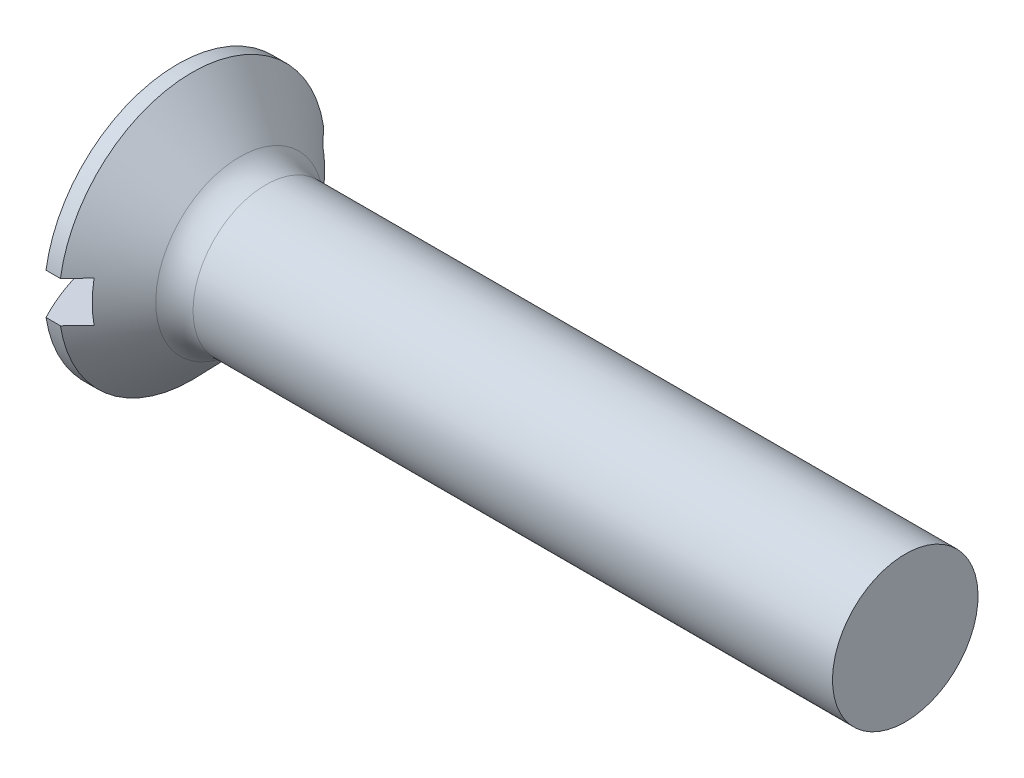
ISO-10303-21;
HEADER;
FILE_DESCRIPTION(('STEP AP214'),'2;1');
FILE_NAME('part.step','',(''),(''),'','','');
FILE_SCHEMA(('AUTOMOTIVE_DESIGN { 1 0 10303 214 1 1 1 1 }'));
ENDSEC;
DATA;
#1=APPLICATION_CONTEXT('core data for automotive mechanical design processes');
#2=APPLICATION_PROTOCOL_DEFINITION('international standard','automotive_design',2000,#1);
#3=PRODUCT_CONTEXT('',#1,'mechanical');
#4=PRODUCT('Part','Part','',(#3));
#5=PRODUCT_RELATED_PRODUCT_CATEGORY('part','',(#4));
#6=PRODUCT_DEFINITION_FORMATION('','',#4);
#7=PRODUCT_DEFINITION_CONTEXT('part definition',#1,'design');
#8=PRODUCT_DEFINITION('design','',#6,#7);
#9=PRODUCT_DEFINITION_SHAPE('','',#8);
#10=(LENGTH_UNIT() NAMED_UNIT(*) SI_UNIT(.MILLI.,.METRE.));
#11=(NAMED_UNIT(*) PLANE_ANGLE_UNIT() SI_UNIT($,.RADIAN.));
#12=(NAMED_UNIT(*) SI_UNIT($,.STERADIAN.) SOLID_ANGLE_UNIT());
#13=UNCERTAINTY_MEASURE_WITH_UNIT(LENGTH_MEASURE(1.E-05),#10,'distance_accuracy_value','');
#14=(GEOMETRIC_REPRESENTATION_CONTEXT(3) GLOBAL_UNCERTAINTY_ASSIGNED_CONTEXT((#13)) GLOBAL_UNIT_ASSIGNED_CONTEXT((#10,
#11,#12)) REPRESENTATION_CONTEXT('',''));
#15=CARTESIAN_POINT('',(0.,0.,0.));
#16=DIRECTION('',(0.,0.,1.));
#17=DIRECTION('',(1.,0.,0.));
#18=AXIS2_PLACEMENT_3D('',#15,#16,#17);
#19=CARTESIAN_POINT('',(19.5,0.,0.));
#20=DIRECTION('',(-1.,0.,0.));
#21=DIRECTION('',(0.,1.,0.));
#22=AXIS2_PLACEMENT_3D('',#19,#20,#21);
#23=SPHERICAL_SURFACE('',#22,19.5);
#24=CARTESIAN_POINT('',(19.5,-1.405,0.));
#25=DIRECTION('',(0.,1.,0.));
#26=DIRECTION('',(0.,0.,1.));
#27=AXIS2_PLACEMENT_3D('',#24,#25,#26);
#28=CIRCLE('',#27,19.4493181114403);
#29=CARTESIAN_POINT('',(2.28002613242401,-1.405,-9.04148632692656));
#30=VERTEX_POINT('',#29);
#31=CARTESIAN_POINT('',(2.28002613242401,-1.405,9.04148632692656));
#32=VERTEX_POINT('',#31);
#33=EDGE_CURVE('E129',#30,#32,#28,.T.);
#34=ORIENTED_EDGE('',*,*,#33,.F.);
#35=CARTESIAN_POINT('',(2.28002613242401,0.,0.));
#36=DIRECTION('',(-1.,0.,0.));
#37=DIRECTION('',(0.,-1.,0.));
#38=AXIS2_PLACEMENT_3D('',#35,#36,#37);
#39=CIRCLE('',#38,9.15);
#40=EDGE_CURVE('E119',#30,#32,#39,.T.);
#41=ORIENTED_EDGE('',*,*,#40,.T.);
#42=EDGE_LOOP('',(#34,#41));
#43=FACE_BOUND('',#42,.T.);
#44=ADVANCED_FACE('F33',(#43),#23,.T.);
#45=CARTESIAN_POINT('',(19.5,1.405,0.));
#46=DIRECTION('',(0.,-1.,0.));
#47=DIRECTION('',(0.,0.,-1.));
#48=AXIS2_PLACEMENT_3D('',#45,#46,#47);
#49=CIRCLE('',#48,19.4493181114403);
#50=CARTESIAN_POINT('',(2.28002613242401,1.405,9.04148632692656));
#51=VERTEX_POINT('',#50);
#52=CARTESIAN_POINT('',(2.28002613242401,1.405,-9.04148632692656));
#53=VERTEX_POINT('',#52);
#54=EDGE_CURVE('E135',#51,#53,#49,.T.);
#55=ORIENTED_EDGE('',*,*,#54,.F.);
#56=EDGE_CURVE('E116',#51,#53,#39,.T.);
#57=ORIENTED_EDGE('',*,*,#56,.T.);
#58=EDGE_LOOP('',(#55,#57));
#59=FACE_BOUND('',#58,.T.);
#60=ADVANCED_FACE('F150',(#59),#23,.T.);
#61=CARTESIAN_POINT('',(2.28002613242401,0.,0.));
#62=DIRECTION('',(-1.,0.,0.));
#63=DIRECTION('',(0.,-1.,0.));
#64=AXIS2_PLACEMENT_3D('',#61,#62,#63);
#65=CYLINDRICAL_SURFACE('',#64,9.15);
#66=DIRECTION('',(-1.,0.,0.));
#67=VECTOR('',#66,1.);
#68=CARTESIAN_POINT('',(2.28002613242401,-1.405,-9.04148632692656));
#69=LINE('',#68,#67);
#70=CARTESIAN_POINT('',(3.27241771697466,-1.405,-9.04148632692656));
#71=VERTEX_POINT('',#70);
#72=EDGE_CURVE('E131',#71,#30,#69,.T.);
#73=ORIENTED_EDGE('',*,*,#72,.F.);
#74=CARTESIAN_POINT('',(3.27241771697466,0.,0.));
#75=DIRECTION('',(-1.,0.,0.));
#76=DIRECTION('',(0.,-1.,0.));
#77=AXIS2_PLACEMENT_3D('',#74,#75,#76);
#78=CIRCLE('',#77,9.15);
#79=CARTESIAN_POINT('',(3.27241771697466,-1.405,9.04148632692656));
#80=VERTEX_POINT('',#79);
#81=EDGE_CURVE('E123',#71,#80,#78,.T.);
#82=ORIENTED_EDGE('',*,*,#81,.T.);
#83=DIRECTION('',(-1.,0.,0.));
#84=VECTOR('',#83,1.);
#85=CARTESIAN_POINT('',(2.28002613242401,-1.405,9.04148632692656));
#86=LINE('',#85,#84);
#87=EDGE_CURVE('E62',#32,#80,#86,.F.);
#88=ORIENTED_EDGE('',*,*,#87,.F.);
#89=ORIENTED_EDGE('',*,*,#40,.F.);
#90=EDGE_LOOP('',(#73,#82,#88,#89));
#91=FACE_BOUND('',#90,.T.);
#92=ADVANCED_FACE('F152',(#91),#65,.T.);
#93=DIRECTION('',(-1.,0.,0.));
#94=VECTOR('',#93,1.);
#95=CARTESIAN_POINT('',(2.28002613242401,1.405,9.04148632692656));
#96=LINE('',#95,#94);
#97=CARTESIAN_POINT('',(3.27241771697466,1.405,9.04148632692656));
#98=VERTEX_POINT('',#97);
#99=EDGE_CURVE('E137',#98,#51,#96,.T.);
#100=ORIENTED_EDGE('',*,*,#99,.F.);
#101=CARTESIAN_POINT('',(3.27241771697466,1.405,-9.04148632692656));
#102=VERTEX_POINT('',#101);
#103=EDGE_CURVE('E122',#98,#102,#78,.T.);
#104=ORIENTED_EDGE('',*,*,#103,.T.);
#105=DIRECTION('',(-1.,0.,0.));
#106=VECTOR('',#105,1.);
#107=CARTESIAN_POINT('',(2.28002613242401,1.405,-9.04148632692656));
#108=LINE('',#107,#106);
#109=EDGE_CURVE('E133',#53,#102,#108,.F.);
#110=ORIENTED_EDGE('',*,*,#109,.F.);
#111=ORIENTED_EDGE('',*,*,#56,.F.);
#112=EDGE_LOOP('',(#100,#104,#110,#111));
#113=FACE_BOUND('',#112,.T.);
#114=ADVANCED_FACE('F145',(#113),#65,.T.);
#115=CARTESIAN_POINT('',(7.28002613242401,0.,0.));
#116=DIRECTION('',(-1.,0.,0.));
#117=DIRECTION('',(0.,-1.,0.));
#118=AXIS2_PLACEMENT_3D('',#115,#116,#117);
#119=CONICAL_SURFACE('',#118,5.,0.802851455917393);
#120=CARTESIAN_POINT('',(6.54286367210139,0.,0.));
#121=DIRECTION('',(-1.,0.,0.));
#122=DIRECTION('',(0.,-1.,0.));
#123=AXIS2_PLACEMENT_3D('',#120,#121,#122);
#124=CIRCLE('',#123,5.76335407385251);
#125=CARTESIAN_POINT('',(6.54286367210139,-5.76335407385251,0.));
#126=VERTEX_POINT('',#125);
#127=EDGE_CURVE('E112',#126,#126,#124,.T.);
#128=ORIENTED_EDGE('',*,*,#127,.T.);
#129=EDGE_LOOP('',(#128));
#130=FACE_BOUND('',#129,.T.);
#131=CARTESIAN_POINT('',(-7.39839007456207,-1.405,20.1510235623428));
#132=CARTESIAN_POINT('',(-6.71531421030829,-1.405,19.4419459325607));
#133=CARTESIAN_POINT('',(-6.03231499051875,-1.405,18.7327944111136));
#134=CARTESIAN_POINT('',(-4.6665504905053,-1.405,17.3142214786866));
#135=CARTESIAN_POINT('',(-3.9837852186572,-1.405,16.604800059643));
#136=CARTESIAN_POINT('',(-2.61810862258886,-1.405,15.1850862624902));
#137=CARTESIAN_POINT('',(-1.93519756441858,-1.405,14.4747936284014));
#138=CARTESIAN_POINT('',(-0.56995355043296,-1.405,13.0536965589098));
#139=CARTESIAN_POINT('',(0.112379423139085,-1.405,12.342892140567));
#140=CARTESIAN_POINT('',(1.46795705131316,-1.405,10.9289617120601));
#141=CARTESIAN_POINT('',(2.14121244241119,-1.405,10.2258460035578));
#142=CARTESIAN_POINT('',(3.14991742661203,-1.405,9.1699806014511));
#143=CARTESIAN_POINT('',(3.48597254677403,-1.405,8.8178095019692));
#144=CARTESIAN_POINT('',(4.15749783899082,-1.405,8.11291635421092));
#145=CARTESIAN_POINT('',(4.49296801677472,-1.405,7.76019431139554));
#146=CARTESIAN_POINT('',(5.16289211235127,-1.405,7.05409748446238));
#147=CARTESIAN_POINT('',(5.49734642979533,-1.405,6.70072307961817));
#148=CARTESIAN_POINT('',(6.16493175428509,-1.405,5.99269868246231));
#149=CARTESIAN_POINT('',(6.49806271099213,-1.405,5.63804864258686));
#150=CARTESIAN_POINT('',(6.9959956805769,-1.405,5.10448322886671));
#151=CARTESIAN_POINT('',(7.16166553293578,-1.405,4.92637811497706));
#152=CARTESIAN_POINT('',(7.49220461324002,-1.405,4.56942691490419));
#153=CARTESIAN_POINT('',(7.65707384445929,-1.405,4.39058083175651));
#154=CARTESIAN_POINT('',(7.9856749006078,-1.405,4.03186599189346));
#155=CARTESIAN_POINT('',(8.14940679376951,-1.405,3.85199729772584));
#156=CARTESIAN_POINT('',(8.47521264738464,-1.405,3.49076595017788));
#157=CARTESIAN_POINT('',(8.637286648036,-1.405,3.30940333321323));
#158=CARTESIAN_POINT('',(8.83988374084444,-1.405,3.07939528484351));
#159=CARTESIAN_POINT('',(8.88162752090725,-1.405,3.03182493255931));
#160=CARTESIAN_POINT('',(8.96490930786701,-1.405,2.93650419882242));
#161=CARTESIAN_POINT('',(9.00644731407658,-1.405,2.88875381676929));
#162=CARTESIAN_POINT('',(9.13071566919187,-1.405,2.7451942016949));
#163=CARTESIAN_POINT('',(9.21309615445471,-1.405,2.64908125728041));
#164=CARTESIAN_POINT('',(9.37685447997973,-1.405,2.45551219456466));
#165=CARTESIAN_POINT('',(9.45822861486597,-1.405,2.35805293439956));
#166=CARTESIAN_POINT('',(9.61924074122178,-1.405,2.16172699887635));
#167=CARTESIAN_POINT('',(9.69887896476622,-1.405,2.06286051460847));
#168=CARTESIAN_POINT('',(9.84897776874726,-1.405,1.87172069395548));
#169=CARTESIAN_POINT('',(9.91964056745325,-1.405,1.77960706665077));
#170=CARTESIAN_POINT('',(10.0579680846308,-1.405,1.59316847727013));
#171=CARTESIAN_POINT('',(10.1256333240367,-1.405,1.49884390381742));
#172=CARTESIAN_POINT('',(10.2563922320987,-1.405,1.30723742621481));
#173=CARTESIAN_POINT('',(10.3194929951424,-1.405,1.20996046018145));
#174=CARTESIAN_POINT('',(10.4087569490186,-1.405,1.0608681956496));
#175=CARTESIAN_POINT('',(10.4375998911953,-1.405,1.01066871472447));
#176=CARTESIAN_POINT('',(10.4929757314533,-1.405,0.909017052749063));
#177=CARTESIAN_POINT('',(10.5195084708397,-1.405,0.857564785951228));
#178=CARTESIAN_POINT('',(10.5888944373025,-1.405,0.713098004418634));
#179=CARTESIAN_POINT('',(10.6286443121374,-1.405,0.618492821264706));
#180=CARTESIAN_POINT('',(10.6774849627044,-1.405,0.473112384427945));
#181=CARTESIAN_POINT('',(10.6919552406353,-1.405,0.424143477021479));
#182=CARTESIAN_POINT('',(10.7165842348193,-1.405,0.325145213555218));
#183=CARTESIAN_POINT('',(10.7267461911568,-1.405,0.275116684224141));
#184=CARTESIAN_POINT('',(10.7409430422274,-1.405,0.182029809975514));
#185=CARTESIAN_POINT('',(10.7456783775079,-1.405,0.139078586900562));
#186=CARTESIAN_POINT('',(10.7513488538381,-1.405,0.0529264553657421));
#187=CARTESIAN_POINT('',(10.7522845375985,-1.405,0.00972558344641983));
#188=CARTESIAN_POINT('',(10.7503022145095,-1.405,-0.0765762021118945));
#189=CARTESIAN_POINT('',(10.7473851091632,-1.405,-0.119677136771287));
#190=CARTESIAN_POINT('',(10.7378638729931,-1.405,-0.205469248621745));
#191=CARTESIAN_POINT('',(10.7312590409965,-1.405,-0.248160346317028));
#192=CARTESIAN_POINT('',(10.7116564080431,-1.405,-0.348398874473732));
#193=CARTESIAN_POINT('',(10.6972032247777,-1.405,-0.405661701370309));
#194=CARTESIAN_POINT('',(10.6631218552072,-1.405,-0.518634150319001));
#195=CARTESIAN_POINT('',(10.6434894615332,-1.405,-0.574342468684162));
#196=CARTESIAN_POINT('',(10.6000352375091,-1.405,-0.684435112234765));
#197=CARTESIAN_POINT('',(10.5761907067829,-1.405,-0.738810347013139));
#198=CARTESIAN_POINT('',(10.525331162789,-1.405,-0.846019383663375));
#199=CARTESIAN_POINT('',(10.4983170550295,-1.405,-0.898853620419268));
#200=CARTESIAN_POINT('',(10.442706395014,-1.405,-1.00158712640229));
#201=CARTESIAN_POINT('',(10.4141837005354,-1.405,-1.05152672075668));
#202=CARTESIAN_POINT('',(10.3553304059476,-1.405,-1.1503329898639));
#203=CARTESIAN_POINT('',(10.3249995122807,-1.405,-1.19919948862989));
#204=CARTESIAN_POINT('',(10.2318456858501,-1.405,-1.34449877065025));
#205=CARTESIAN_POINT('',(10.1668980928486,-1.405,-1.43956637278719));
#206=CARTESIAN_POINT('',(10.0332082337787,-1.405,-1.62731827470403));
#207=CARTESIAN_POINT('',(9.96445668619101,-1.405,-1.71999585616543));
#208=CARTESIAN_POINT('',(9.82445560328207,-1.405,-1.90345529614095));
#209=CARTESIAN_POINT('',(9.75320575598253,-1.405,-1.99423691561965));
#210=CARTESIAN_POINT('',(9.60862433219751,-1.405,-2.17479145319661));
#211=CARTESIAN_POINT('',(9.53528483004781,-1.405,-2.26455799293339));
#212=CARTESIAN_POINT('',(9.3873025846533,-1.405,-2.44302060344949));
#213=CARTESIAN_POINT('',(9.31265973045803,-1.405,-2.53171658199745));
#214=CARTESIAN_POINT('',(9.16253475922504,-1.405,-2.70811752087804));
#215=CARTESIAN_POINT('',(9.08705440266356,-1.405,-2.79582398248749));
#216=CARTESIAN_POINT('',(8.93534550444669,-1.405,-2.97058132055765));
#217=CARTESIAN_POINT('',(8.85911698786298,-1.405,-3.05763221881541));
#218=CARTESIAN_POINT('',(8.63162195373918,-1.405,-3.31566553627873));
#219=CARTESIAN_POINT('',(8.47950949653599,-1.405,-3.48590171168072));
#220=CARTESIAN_POINT('',(8.17380248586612,-1.405,-3.82503932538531));
#221=CARTESIAN_POINT('',(8.02020790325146,-1.405,-3.99394073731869));
#222=CARTESIAN_POINT('',(7.7119803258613,-1.405,-4.3308127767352));
#223=CARTESIAN_POINT('',(7.55734726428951,-1.405,-4.49878334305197));
#224=CARTESIAN_POINT('',(7.24733874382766,-1.405,-4.83403834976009));
#225=CARTESIAN_POINT('',(7.09196328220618,-1.405,-5.00132278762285));
#226=CARTESIAN_POINT('',(6.62476963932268,-1.405,-5.50268524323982));
#227=CARTESIAN_POINT('',(6.31213381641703,-1.405,-5.8360010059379));
#228=CARTESIAN_POINT('',(5.68558901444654,-1.405,-6.50140825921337));
#229=CARTESIAN_POINT('',(5.37168008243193,-1.405,-6.83349979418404));
#230=CARTESIAN_POINT('',(4.74470671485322,-1.405,-7.49511392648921));
#231=CARTESIAN_POINT('',(4.43164674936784,-1.405,-7.82464076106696));
#232=CARTESIAN_POINT('',(3.80495649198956,-1.405,-8.48315736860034));
#233=CARTESIAN_POINT('',(3.49132619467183,-1.405,-8.81214713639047));
#234=CARTESIAN_POINT('',(2.55001232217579,-1.405,-9.79836333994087));
#235=CARTESIAN_POINT('',(1.92173176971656,-1.405,-10.4550198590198));
#236=CARTESIAN_POINT('',(0.57207063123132,-1.405,-11.8637518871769));
#237=CARTESIAN_POINT('',(-0.149447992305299,-1.405,-12.6156950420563));
#238=CARTESIAN_POINT('',(-1.59322919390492,-1.405,-14.1190060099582));
#239=CARTESIAN_POINT('',(-2.31549183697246,-1.405,-14.8703737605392));
#240=CARTESIAN_POINT('',(-3.76439792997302,-1.405,-16.3768173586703));
#241=CARTESIAN_POINT('',(-4.49104370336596,-1.405,-17.131890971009));
#242=CARTESIAN_POINT('',(-5.94456176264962,-1.405,-18.6416778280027));
#243=CARTESIAN_POINT('',(-6.67143401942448,-1.405,-19.3963911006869));
#244=CARTESIAN_POINT('',(-7.39839007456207,-1.405,-20.1510235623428));
#245=B_SPLINE_CURVE_WITH_KNOTS('',3,(#131,#132,#133,#134,#135,#136,#137,#138,#139,#140,#141,
#142,#143,#144,#145,#146,#147,#148,#149,#150,#151,#152,#153,#154,#155,#156,#157,#158,#159,#160,
#161,#162,#163,#164,#165,#166,#167,#168,#169,#170,#171,#172,#173,#174,#175,#176,#177,#178,#179,
#180,#181,#182,#183,#184,#185,#186,#187,#188,#189,#190,#191,#192,#193,#194,#195,#196,#197,#198,
#199,#200,#201,#202,#203,#204,#205,#206,#207,#208,#209,#210,#211,#212,#213,#214,#215,#216,#217,
#218,#219,#220,#221,#222,#223,#224,#225,#226,#227,#228,#229,#230,#231,#232,#233,#234,#235,#236,
#237,#238,#239,#240,#241,#242,#243,#244),.UNSPECIFIED.,.F.,.F.,(4,2,2,2,2,2,2,2,2,2,2,2,2,2,2,2,
2,2,2,2,2,2,2,2,2,2,2,2,2,2,2,2,2,2,2,2,2,2,2,2,2,2,2,2,2,2,2,2,2,2,2,2,2,2,2,2,4),(0.,
2.95371864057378,5.90753382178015,8.86353566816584,11.8194431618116,14.7398524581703,
16.2002005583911,17.6605342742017,19.120189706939,20.5799001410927,21.3096323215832,
22.0393615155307,22.769046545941,23.4987138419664,23.6885799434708,23.878446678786,
24.2581991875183,24.6390797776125,25.0199091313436,25.3681523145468,25.7163347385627,
26.0639638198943,26.2375946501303,26.4112373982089,26.7181513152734,26.8711861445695,
27.0241056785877,27.1535838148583,27.2830434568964,27.4124728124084,27.5419267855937,
27.7187869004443,27.8957911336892,28.073780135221,28.251718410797,28.4242040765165,
28.596717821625,28.9419684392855,29.2881021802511,29.6342793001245,29.98201438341,
30.3297792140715,30.6769155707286,31.0240403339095,31.7089093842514,32.3937919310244,
33.078718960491,33.763648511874,35.1346137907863,36.5055288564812,37.8691077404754,
39.2326996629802,41.9591255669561,45.0854757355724,48.2121272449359,51.3559070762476,
54.4993793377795),.UNSPECIFIED.);
#246=CARTESIAN_POINT('',(4.4,-1.405,7.85773225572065));
#247=VERTEX_POINT('',#246);
#248=EDGE_CURVE('E11',#80,#247,#245,.T.);
#249=ORIENTED_EDGE('',*,*,#248,.F.);
#250=ORIENTED_EDGE('',*,*,#81,.F.);
#251=CARTESIAN_POINT('',(4.4,-1.405,-7.85773225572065));
#252=VERTEX_POINT('',#251);
#253=EDGE_CURVE('E37',#252,#71,#245,.T.);
#254=ORIENTED_EDGE('',*,*,#253,.F.);
#255=CARTESIAN_POINT('',(4.4,0.,0.));
#256=DIRECTION('',(1.,0.,0.));
#257=DIRECTION('',(0.,0.,-1.));
#258=AXIS2_PLACEMENT_3D('',#255,#256,#257);
#259=CIRCLE('',#258,7.98235436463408);
#260=CARTESIAN_POINT('',(4.4,1.405,-7.85773225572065));
#261=VERTEX_POINT('',#260);
#262=EDGE_CURVE('E101',#252,#261,#259,.T.);
#263=ORIENTED_EDGE('',*,*,#262,.T.);
#264=CARTESIAN_POINT('',(-7.39839007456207,1.405,-20.1510235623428));
#265=CARTESIAN_POINT('',(-6.71531421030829,1.405,-19.4419459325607));
#266=CARTESIAN_POINT('',(-6.03231499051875,1.405,-18.7327944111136));
#267=CARTESIAN_POINT('',(-4.66655049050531,1.405,-17.3142214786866));
#268=CARTESIAN_POINT('',(-3.98378521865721,1.405,-16.604800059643));
#269=CARTESIAN_POINT('',(-2.61810862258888,1.405,-15.1850862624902));
#270=CARTESIAN_POINT('',(-1.9351975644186,1.405,-14.4747936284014));
#271=CARTESIAN_POINT('',(-0.569953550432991,1.405,-13.0536965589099));
#272=CARTESIAN_POINT('',(0.112379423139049,1.405,-12.342892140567));
#273=CARTESIAN_POINT('',(1.46795705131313,1.405,-10.9289617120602));
#274=CARTESIAN_POINT('',(2.14121244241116,1.405,-10.2258460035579));
#275=CARTESIAN_POINT('',(3.149917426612,1.405,-9.16998060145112));
#276=CARTESIAN_POINT('',(3.48597254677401,1.405,-8.81780950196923));
#277=CARTESIAN_POINT('',(4.15749783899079,1.405,-8.11291635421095));
#278=CARTESIAN_POINT('',(4.4929680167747,1.405,-7.76019431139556));
#279=CARTESIAN_POINT('',(5.16289211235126,1.405,-7.0540974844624));
#280=CARTESIAN_POINT('',(5.49734642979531,1.405,-6.70072307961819));
#281=CARTESIAN_POINT('',(6.16493175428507,1.405,-5.99269868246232));
#282=CARTESIAN_POINT('',(6.49806271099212,1.405,-5.63804864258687));
#283=CARTESIAN_POINT('',(6.99599568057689,1.405,-5.10448322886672));
#284=CARTESIAN_POINT('',(7.16166553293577,1.405,-4.92637811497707));
#285=CARTESIAN_POINT('',(7.49220461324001,1.405,-4.5694269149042));
#286=CARTESIAN_POINT('',(7.65707384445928,1.405,-4.39058083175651));
#287=CARTESIAN_POINT('',(7.9856749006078,1.405,-4.03186599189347));
#288=CARTESIAN_POINT('',(8.14940679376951,1.405,-3.85199729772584));
#289=CARTESIAN_POINT('',(8.47521264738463,1.405,-3.49076595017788));
#290=CARTESIAN_POINT('',(8.637286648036,1.405,-3.30940333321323));
#291=CARTESIAN_POINT('',(8.83988374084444,1.405,-3.07939528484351));
#292=CARTESIAN_POINT('',(8.88162752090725,1.405,-3.03182493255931));
#293=CARTESIAN_POINT('',(8.96490930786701,1.405,-2.93650419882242));
#294=CARTESIAN_POINT('',(9.00644731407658,1.405,-2.88875381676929));
#295=CARTESIAN_POINT('',(9.13071566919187,1.405,-2.7451942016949));
#296=CARTESIAN_POINT('',(9.21309615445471,1.405,-2.64908125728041));
#297=CARTESIAN_POINT('',(9.37685447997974,1.405,-2.45551219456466));
#298=CARTESIAN_POINT('',(9.45822861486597,1.405,-2.35805293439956));
#299=CARTESIAN_POINT('',(9.61924074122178,1.405,-2.16172699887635));
#300=CARTESIAN_POINT('',(9.69887896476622,1.405,-2.06286051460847));
#301=CARTESIAN_POINT('',(9.84897776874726,1.405,-1.87172069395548));
#302=CARTESIAN_POINT('',(9.91964056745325,1.405,-1.77960706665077));
#303=CARTESIAN_POINT('',(10.0579680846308,1.405,-1.59316847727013));
#304=CARTESIAN_POINT('',(10.1256333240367,1.405,-1.49884390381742));
#305=CARTESIAN_POINT('',(10.2563922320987,1.405,-1.30723742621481));
#306=CARTESIAN_POINT('',(10.3194929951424,1.405,-1.20996046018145));
#307=CARTESIAN_POINT('',(10.4087569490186,1.405,-1.0608681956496));
#308=CARTESIAN_POINT('',(10.4375998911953,1.405,-1.01066871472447));
#309=CARTESIAN_POINT('',(10.4929757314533,1.405,-0.909017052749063));
#310=CARTESIAN_POINT('',(10.5195084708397,1.405,-0.857564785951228));
#311=CARTESIAN_POINT('',(10.5888944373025,1.405,-0.713098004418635));
#312=CARTESIAN_POINT('',(10.6286443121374,1.405,-0.618492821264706));
#313=CARTESIAN_POINT('',(10.6774849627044,1.405,-0.473112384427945));
#314=CARTESIAN_POINT('',(10.6919552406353,1.405,-0.424143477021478));
#315=CARTESIAN_POINT('',(10.7165842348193,1.405,-0.325145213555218));
#316=CARTESIAN_POINT('',(10.7267461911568,1.405,-0.275116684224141));
#317=CARTESIAN_POINT('',(10.7409430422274,1.405,-0.182029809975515));
#318=CARTESIAN_POINT('',(10.7456783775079,1.405,-0.139078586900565));
#319=CARTESIAN_POINT('',(10.7513488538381,1.405,-0.0529264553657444));
#320=CARTESIAN_POINT('',(10.7522845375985,1.405,-0.00972558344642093));
#321=CARTESIAN_POINT('',(10.7503022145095,1.405,0.0765762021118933));
#322=CARTESIAN_POINT('',(10.7473851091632,1.405,0.119677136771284));
#323=CARTESIAN_POINT('',(10.7378638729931,1.405,0.205469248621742));
#324=CARTESIAN_POINT('',(10.7312590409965,1.405,0.248160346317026));
#325=CARTESIAN_POINT('',(10.7116564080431,1.405,0.348398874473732));
#326=CARTESIAN_POINT('',(10.6972032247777,1.405,0.405661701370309));
#327=CARTESIAN_POINT('',(10.6631218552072,1.405,0.518634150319));
#328=CARTESIAN_POINT('',(10.6434894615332,1.405,0.574342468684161));
#329=CARTESIAN_POINT('',(10.6000352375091,1.405,0.684435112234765));
#330=CARTESIAN_POINT('',(10.5761907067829,1.405,0.738810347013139));
#331=CARTESIAN_POINT('',(10.525331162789,1.405,0.846019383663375));
#332=CARTESIAN_POINT('',(10.4983170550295,1.405,0.898853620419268));
#333=CARTESIAN_POINT('',(10.442706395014,1.405,1.00158712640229));
#334=CARTESIAN_POINT('',(10.4141837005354,1.405,1.05152672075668));
#335=CARTESIAN_POINT('',(10.3553304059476,1.405,1.1503329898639));
#336=CARTESIAN_POINT('',(10.3249995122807,1.405,1.19919948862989));
#337=CARTESIAN_POINT('',(10.2318456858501,1.405,1.34449877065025));
#338=CARTESIAN_POINT('',(10.1668980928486,1.405,1.4395663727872));
#339=CARTESIAN_POINT('',(10.0332082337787,1.405,1.62731827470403));
#340=CARTESIAN_POINT('',(9.964456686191,1.405,1.71999585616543));
#341=CARTESIAN_POINT('',(9.82445560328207,1.405,1.90345529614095));
#342=CARTESIAN_POINT('',(9.75320575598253,1.405,1.99423691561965));
#343=CARTESIAN_POINT('',(9.60862433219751,1.405,2.17479145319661));
#344=CARTESIAN_POINT('',(9.53528483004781,1.405,2.26455799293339));
#345=CARTESIAN_POINT('',(9.3873025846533,1.405,2.44302060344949));
#346=CARTESIAN_POINT('',(9.31265973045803,1.405,2.53171658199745));
#347=CARTESIAN_POINT('',(9.16253475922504,1.405,2.70811752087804));
#348=CARTESIAN_POINT('',(9.08705440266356,1.405,2.7958239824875));
#349=CARTESIAN_POINT('',(8.93534550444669,1.405,2.97058132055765));
#350=CARTESIAN_POINT('',(8.85911698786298,1.405,3.05763221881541));
#351=CARTESIAN_POINT('',(8.63162195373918,1.405,3.31566553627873));
#352=CARTESIAN_POINT('',(8.47950949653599,1.405,3.48590171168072));
#353=CARTESIAN_POINT('',(8.17380248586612,1.405,3.82503932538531));
#354=CARTESIAN_POINT('',(8.02020790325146,1.405,3.99394073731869));
#355=CARTESIAN_POINT('',(7.7119803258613,1.405,4.3308127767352));
#356=CARTESIAN_POINT('',(7.55734726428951,1.405,4.49878334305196));
#357=CARTESIAN_POINT('',(7.24733874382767,1.405,4.83403834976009));
#358=CARTESIAN_POINT('',(7.09196328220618,1.405,5.00132278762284));
#359=CARTESIAN_POINT('',(6.62476963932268,1.405,5.50268524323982));
#360=CARTESIAN_POINT('',(6.31213381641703,1.405,5.8360010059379));
#361=CARTESIAN_POINT('',(5.68558901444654,1.405,6.50140825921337));
#362=CARTESIAN_POINT('',(5.37168008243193,1.405,6.83349979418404));
#363=CARTESIAN_POINT('',(4.74470671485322,1.405,7.49511392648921));
#364=CARTESIAN_POINT('',(4.43164674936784,1.405,7.82464076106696));
#365=CARTESIAN_POINT('',(3.80495649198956,1.405,8.48315736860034));
#366=CARTESIAN_POINT('',(3.49132619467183,1.405,8.81214713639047));
#367=CARTESIAN_POINT('',(2.55001232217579,1.405,9.79836333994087));
#368=CARTESIAN_POINT('',(1.92173176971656,1.405,10.4550198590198));
#369=CARTESIAN_POINT('',(0.57207063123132,1.405,11.8637518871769));
#370=CARTESIAN_POINT('',(-0.149447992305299,1.405,12.6156950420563));
#371=CARTESIAN_POINT('',(-1.59322919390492,1.405,14.1190060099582));
#372=CARTESIAN_POINT('',(-2.31549183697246,1.405,14.8703737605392));
#373=CARTESIAN_POINT('',(-3.76439792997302,1.405,16.3768173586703));
#374=CARTESIAN_POINT('',(-4.49104370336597,1.405,17.131890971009));
#375=CARTESIAN_POINT('',(-5.94456176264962,1.405,18.6416778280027));
#376=CARTESIAN_POINT('',(-6.67143401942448,1.405,19.3963911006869));
#377=CARTESIAN_POINT('',(-7.39839007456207,1.405,20.1510235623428));
#378=B_SPLINE_CURVE_WITH_KNOTS('',3,(#264,#265,#266,#267,#268,#269,#270,#271,#272,#273,#274,
#275,#276,#277,#278,#279,#280,#281,#282,#283,#284,#285,#286,#287,#288,#289,#290,#291,#292,#293,
#294,#295,#296,#297,#298,#299,#300,#301,#302,#303,#304,#305,#306,#307,#308,#309,#310,#311,#312,
#313,#314,#315,#316,#317,#318,#319,#320,#321,#322,#323,#324,#325,#326,#327,#328,#329,#330,#331,
#332,#333,#334,#335,#336,#337,#338,#339,#340,#341,#342,#343,#344,#345,#346,#347,#348,#349,#350,
#351,#352,#353,#354,#355,#356,#357,#358,#359,#360,#361,#362,#363,#364,#365,#366,#367,#368,#369,
#370,#371,#372,#373,#374,#375,#376,#377),.UNSPECIFIED.,.F.,.F.,(4,2,2,2,2,2,2,2,2,2,2,2,2,2,2,2,
2,2,2,2,2,2,2,2,2,2,2,2,2,2,2,2,2,2,2,2,2,2,2,2,2,2,2,2,2,2,2,2,2,2,2,2,2,2,2,2,4),(0.,
2.95371864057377,5.90753382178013,8.8635356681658,11.8194431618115,14.7398524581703,
16.2002005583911,17.6605342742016,19.120189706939,20.5799001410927,21.3096323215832,
22.0393615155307,22.769046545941,23.4987138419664,23.6885799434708,23.878446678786,
24.2581991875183,24.6390797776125,25.0199091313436,25.3681523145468,25.7163347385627,
26.0639638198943,26.2375946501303,26.411237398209,26.7181513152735,26.8711861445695,
27.0241056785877,27.1535838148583,27.2830434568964,27.4124728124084,27.5419267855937,
27.7187869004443,27.8957911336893,28.073780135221,28.251718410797,28.4242040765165,
28.596717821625,28.9419684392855,29.2881021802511,29.6342793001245,29.98201438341,
30.3297792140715,30.6769155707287,31.0240403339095,31.7089093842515,32.3937919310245,
33.078718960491,33.7636485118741,35.1346137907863,36.5055288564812,37.8691077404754,
39.2326996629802,41.9591255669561,45.0854757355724,48.2121272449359,51.3559070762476,
54.4993793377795),.UNSPECIFIED.);
#379=EDGE_CURVE('E107',#102,#261,#378,.T.);
#380=ORIENTED_EDGE('',*,*,#379,.F.);
#381=ORIENTED_EDGE('',*,*,#103,.F.);
#382=CARTESIAN_POINT('',(4.4,1.405,7.85773225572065));
#383=VERTEX_POINT('',#382);
#384=EDGE_CURVE('E48',#383,#98,#378,.T.);
#385=ORIENTED_EDGE('',*,*,#384,.F.);
#386=EDGE_CURVE('E99',#383,#247,#259,.T.);
#387=ORIENTED_EDGE('',*,*,#386,.T.);
#388=EDGE_LOOP('',(#249,#250,#254,#263,#380,#381,#385,#387));
#389=FACE_BOUND('',#388,.T.);
#390=ADVANCED_FACE('F104',(#130,#389),#119,.T.);
#391=CARTESIAN_POINT('',(2.28002613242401,0.,0.));
#392=DIRECTION('',(-1.,0.,0.));
#393=DIRECTION('',(0.,-1.,0.));
#394=AXIS2_PLACEMENT_3D('',#391,#392,#393);
#395=CYLINDRICAL_SURFACE('',#394,5.);
#396=CARTESIAN_POINT('',(8.34121317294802,0.,0.));
#397=DIRECTION('',(-1.,0.,0.));
#398=DIRECTION('',(0.,-1.,0.));
#399=AXIS2_PLACEMENT_3D('',#396,#397,#398);
#400=CIRCLE('',#399,5.);
#401=CARTESIAN_POINT('',(8.34121317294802,-5.,0.));
#402=VERTEX_POINT('',#401);
#403=EDGE_CURVE('E109',#402,#402,#400,.F.);
#404=ORIENTED_EDGE('',*,*,#403,.T.);
#405=EDGE_LOOP('',(#404));
#406=FACE_BOUND('',#405,.T.);
#407=CARTESIAN_POINT('',(52.280026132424,0.,0.));
#408=DIRECTION('',(-1.,0.,0.));
#409=DIRECTION('',(0.,-1.,0.));
#410=AXIS2_PLACEMENT_3D('',#407,#408,#409);
#411=CIRCLE('',#410,5.);
#412=CARTESIAN_POINT('',(52.280026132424,-5.,0.));
#413=VERTEX_POINT('',#412);
#414=EDGE_CURVE('E125',#413,#413,#411,.T.);
#415=ORIENTED_EDGE('',*,*,#414,.T.);
#416=EDGE_LOOP('',(#415));
#417=FACE_BOUND('',#416,.T.);
#418=ADVANCED_FACE('F163',(#406,#417),#395,.T.);
#419=CARTESIAN_POINT('',(52.280026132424,5.,0.));
#420=DIRECTION('',(-1.,0.,0.));
#421=DIRECTION('',(0.,-1.,0.));
#422=AXIS2_PLACEMENT_3D('',#419,#420,#421);
#423=PLANE('',#422);
#424=ORIENTED_EDGE('',*,*,#414,.F.);
#425=EDGE_LOOP('',(#424));
#426=FACE_BOUND('',#425,.T.);
#427=ADVANCED_FACE('F177',(#426),#423,.F.);
#428=CARTESIAN_POINT('',(8.34121317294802,0.,0.));
#429=DIRECTION('',(-1.,0.,0.));
#430=DIRECTION('',(0.,-1.,0.));
#431=AXIS2_PLACEMENT_3D('',#428,#429,#430);
#432=TOROIDAL_SURFACE('',#431,7.5,2.5);
#433=ORIENTED_EDGE('',*,*,#403,.F.);
#434=EDGE_LOOP('',(#433));
#435=FACE_BOUND('',#434,.T.);
#436=ORIENTED_EDGE('',*,*,#127,.F.);
#437=EDGE_LOOP('',(#436));
#438=FACE_BOUND('',#437,.T.);
#439=ADVANCED_FACE('F35',(#435,#438),#432,.F.);
#440=CARTESIAN_POINT('',(4.4,-1.405,9.15));
#441=DIRECTION('',(0.,1.,0.));
#442=DIRECTION('',(0.,0.,1.));
#443=AXIS2_PLACEMENT_3D('',#440,#441,#442);
#444=PLANE('',#443);
#445=ORIENTED_EDGE('',*,*,#248,.T.);
#446=DIRECTION('',(0.,0.,-1.));
#447=VECTOR('',#446,1.);
#448=CARTESIAN_POINT('',(4.4,-1.405,9.15));
#449=LINE('',#448,#447);
#450=EDGE_CURVE('E92',#247,#252,#449,.T.);
#451=ORIENTED_EDGE('',*,*,#450,.T.);
#452=ORIENTED_EDGE('',*,*,#253,.T.);
#453=ORIENTED_EDGE('',*,*,#72,.T.);
#454=ORIENTED_EDGE('',*,*,#33,.T.);
#455=ORIENTED_EDGE('',*,*,#87,.T.);
#456=EDGE_LOOP('',(#445,#451,#452,#453,#454,#455));
#457=FACE_BOUND('',#456,.T.);
#458=ADVANCED_FACE('F91',(#457),#444,.T.);
#459=CARTESIAN_POINT('',(4.4,1.405,9.15));
#460=DIRECTION('',(0.,-1.,0.));
#461=DIRECTION('',(0.,0.,-1.));
#462=AXIS2_PLACEMENT_3D('',#459,#460,#461);
#463=PLANE('',#462);
#464=ORIENTED_EDGE('',*,*,#379,.T.);
#465=DIRECTION('',(0.,0.,1.));
#466=VECTOR('',#465,1.);
#467=CARTESIAN_POINT('',(4.4,1.405,9.15));
#468=LINE('',#467,#466);
#469=EDGE_CURVE('E55',#261,#383,#468,.T.);
#470=ORIENTED_EDGE('',*,*,#469,.T.);
#471=ORIENTED_EDGE('',*,*,#384,.T.);
#472=ORIENTED_EDGE('',*,*,#99,.T.);
#473=ORIENTED_EDGE('',*,*,#54,.T.);
#474=ORIENTED_EDGE('',*,*,#109,.T.);
#475=EDGE_LOOP('',(#464,#470,#471,#472,#473,#474));
#476=FACE_BOUND('',#475,.T.);
#477=ADVANCED_FACE('F140',(#476),#463,.T.);
#478=CARTESIAN_POINT('',(4.4,-1.405,9.15));
#479=DIRECTION('',(1.,0.,0.));
#480=DIRECTION('',(0.,0.,-1.));
#481=AXIS2_PLACEMENT_3D('',#478,#479,#480);
#482=PLANE('',#481);
#483=ORIENTED_EDGE('',*,*,#469,.F.);
#484=ORIENTED_EDGE('',*,*,#262,.F.);
#485=ORIENTED_EDGE('',*,*,#450,.F.);
#486=ORIENTED_EDGE('',*,*,#386,.F.);
#487=EDGE_LOOP('',(#483,#484,#485,#486));
#488=FACE_BOUND('',#487,.T.);
#489=ADVANCED_FACE('F98',(#488),#482,.F.);
#490=CLOSED_SHELL('',(#44,#60,#92,#114,#390,#418,#427,#439,#458,#477,#489));
#491=MANIFOLD_SOLID_BREP('B2',#490);
#492=ADVANCED_BREP_SHAPE_REPRESENTATION('',(#18,#491),#14);
#493=SHAPE_DEFINITION_REPRESENTATION(#9,#492);
ENDSEC;
END-ISO-10303-21;
